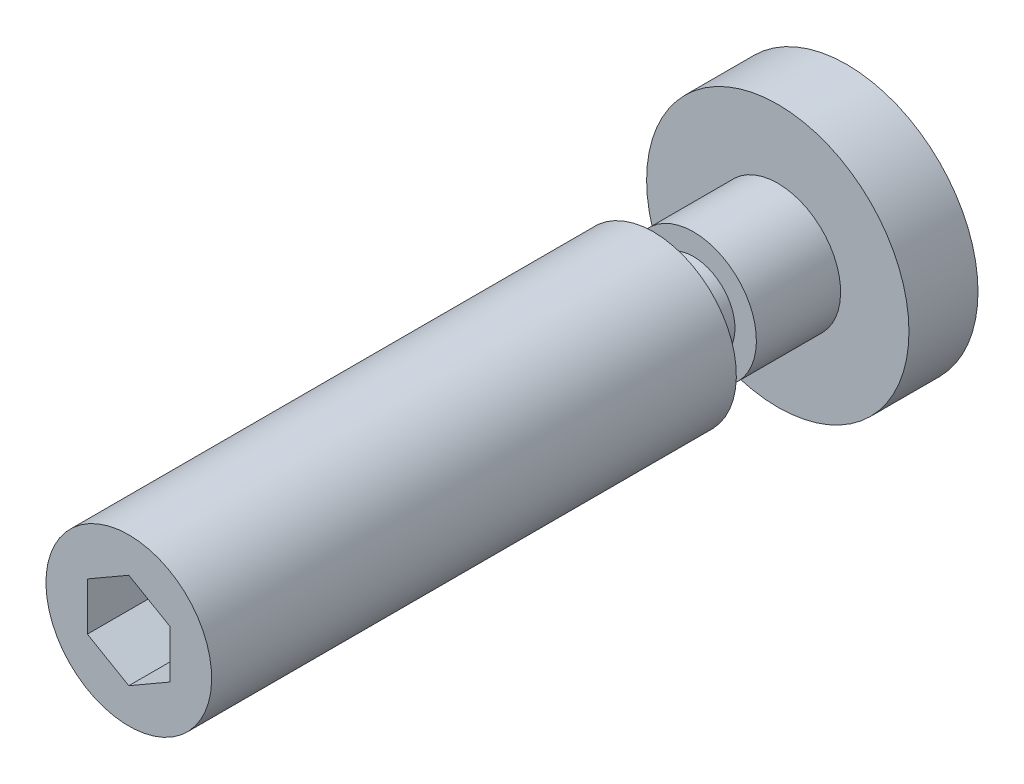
ISO-10303-21;
HEADER;
FILE_DESCRIPTION(('STEP AP214'),'2;1');
FILE_NAME('part.step','',(''),(''),'','','');
FILE_SCHEMA(('AUTOMOTIVE_DESIGN { 1 0 10303 214 1 1 1 1 }'));
ENDSEC;
DATA;
#1=APPLICATION_CONTEXT('core data for automotive mechanical design processes');
#2=APPLICATION_PROTOCOL_DEFINITION('international standard','automotive_design',2000,#1);
#3=PRODUCT_CONTEXT('',#1,'mechanical');
#4=PRODUCT('Part','Part','',(#3));
#5=PRODUCT_RELATED_PRODUCT_CATEGORY('part','',(#4));
#6=PRODUCT_DEFINITION_FORMATION('','',#4);
#7=PRODUCT_DEFINITION_CONTEXT('part definition',#1,'design');
#8=PRODUCT_DEFINITION('design','',#6,#7);
#9=PRODUCT_DEFINITION_SHAPE('','',#8);
#10=(LENGTH_UNIT() NAMED_UNIT(*) SI_UNIT(.MILLI.,.METRE.));
#11=(NAMED_UNIT(*) PLANE_ANGLE_UNIT() SI_UNIT($,.RADIAN.));
#12=(NAMED_UNIT(*) SI_UNIT($,.STERADIAN.) SOLID_ANGLE_UNIT());
#13=UNCERTAINTY_MEASURE_WITH_UNIT(LENGTH_MEASURE(1.E-05),#10,'distance_accuracy_value','');
#14=(GEOMETRIC_REPRESENTATION_CONTEXT(3) GLOBAL_UNCERTAINTY_ASSIGNED_CONTEXT((#13)) GLOBAL_UNIT_ASSIGNED_CONTEXT((#10,
#11,#12)) REPRESENTATION_CONTEXT('',''));
#15=CARTESIAN_POINT('',(0.,0.,0.));
#16=DIRECTION('',(0.,0.,1.));
#17=DIRECTION('',(1.,0.,0.));
#18=AXIS2_PLACEMENT_3D('',#15,#16,#17);
#19=CARTESIAN_POINT('',(0.,0.,0.));
#20=DIRECTION('',(0.,0.,1.));
#21=DIRECTION('',(0.,1.,0.));
#22=AXIS2_PLACEMENT_3D('',#19,#20,#21);
#23=PLANE('',#22);
#24=CARTESIAN_POINT('',(0.,0.,0.));
#25=DIRECTION('',(0.,0.,1.));
#26=DIRECTION('',(0.,1.,0.));
#27=AXIS2_PLACEMENT_3D('',#24,#25,#26);
#28=CIRCLE('',#27,9.5);
#29=CARTESIAN_POINT('',(0.,9.5,0.));
#30=VERTEX_POINT('',#29);
#31=EDGE_CURVE('E9',#30,#30,#28,.T.);
#32=ORIENTED_EDGE('',*,*,#31,.F.);
#33=EDGE_LOOP('',(#32));
#34=FACE_BOUND('',#33,.T.);
#35=ADVANCED_FACE('F14',(#34),#23,.F.);
#36=CARTESIAN_POINT('',(0.,0.,40.));
#37=DIRECTION('',(0.,0.,1.));
#38=DIRECTION('',(0.,1.,0.));
#39=AXIS2_PLACEMENT_3D('',#36,#37,#38);
#40=CYLINDRICAL_SURFACE('',#39,9.5);
#41=CARTESIAN_POINT('',(0.,0.,5.));
#42=DIRECTION('',(0.,0.,1.));
#43=DIRECTION('',(0.,1.,0.));
#44=AXIS2_PLACEMENT_3D('',#41,#42,#43);
#45=CIRCLE('',#44,9.5);
#46=CARTESIAN_POINT('',(0.,9.5,5.));
#47=VERTEX_POINT('',#46);
#48=EDGE_CURVE('E21',#47,#47,#45,.T.);
#49=ORIENTED_EDGE('',*,*,#48,.F.);
#50=EDGE_LOOP('',(#49));
#51=FACE_BOUND('',#50,.T.);
#52=ORIENTED_EDGE('',*,*,#31,.T.);
#53=EDGE_LOOP('',(#52));
#54=FACE_BOUND('',#53,.T.);
#55=ADVANCED_FACE('F142',(#51,#54),#40,.T.);
#56=CARTESIAN_POINT('',(0.,-9.5,5.));
#57=DIRECTION('',(0.,0.,-1.));
#58=DIRECTION('',(0.,-1.,0.));
#59=AXIS2_PLACEMENT_3D('',#56,#57,#58);
#60=PLANE('',#59);
#61=CARTESIAN_POINT('',(0.,0.,5.));
#62=DIRECTION('',(0.,0.,1.));
#63=DIRECTION('',(0.,1.,0.));
#64=AXIS2_PLACEMENT_3D('',#61,#62,#63);
#65=CIRCLE('',#64,4.55);
#66=CARTESIAN_POINT('',(0.,4.55,5.));
#67=VERTEX_POINT('',#66);
#68=EDGE_CURVE('E135',#67,#67,#65,.T.);
#69=ORIENTED_EDGE('',*,*,#68,.F.);
#70=EDGE_LOOP('',(#69));
#71=FACE_BOUND('',#70,.T.);
#72=ORIENTED_EDGE('',*,*,#48,.T.);
#73=EDGE_LOOP('',(#72));
#74=FACE_BOUND('',#73,.T.);
#75=ADVANCED_FACE('F140',(#71,#74),#60,.F.);
#76=CARTESIAN_POINT('',(0.,0.,40.));
#77=DIRECTION('',(0.,0.,1.));
#78=DIRECTION('',(0.,1.,0.));
#79=AXIS2_PLACEMENT_3D('',#76,#77,#78);
#80=CYLINDRICAL_SURFACE('',#79,4.55);
#81=CARTESIAN_POINT('',(0.,0.,11.1));
#82=DIRECTION('',(0.,0.,1.));
#83=DIRECTION('',(0.,1.,0.));
#84=AXIS2_PLACEMENT_3D('',#81,#82,#83);
#85=CIRCLE('',#84,4.55);
#86=CARTESIAN_POINT('',(0.,4.55,11.1));
#87=VERTEX_POINT('',#86);
#88=EDGE_CURVE('E132',#87,#87,#85,.T.);
#89=ORIENTED_EDGE('',*,*,#88,.F.);
#90=EDGE_LOOP('',(#89));
#91=FACE_BOUND('',#90,.T.);
#92=ORIENTED_EDGE('',*,*,#68,.T.);
#93=EDGE_LOOP('',(#92));
#94=FACE_BOUND('',#93,.T.);
#95=ADVANCED_FACE('F165',(#91,#94),#80,.T.);
#96=CARTESIAN_POINT('',(0.,-4.55,11.1));
#97=DIRECTION('',(0.,0.,-1.));
#98=DIRECTION('',(0.,-1.,0.));
#99=AXIS2_PLACEMENT_3D('',#96,#97,#98);
#100=PLANE('',#99);
#101=CARTESIAN_POINT('',(0.,0.,11.1));
#102=DIRECTION('',(0.,0.,1.));
#103=DIRECTION('',(0.,1.,0.));
#104=AXIS2_PLACEMENT_3D('',#101,#102,#103);
#105=CIRCLE('',#104,3.);
#106=CARTESIAN_POINT('',(0.,3.,11.1));
#107=VERTEX_POINT('',#106);
#108=EDGE_CURVE('E129',#107,#107,#105,.T.);
#109=ORIENTED_EDGE('',*,*,#108,.F.);
#110=EDGE_LOOP('',(#109));
#111=FACE_BOUND('',#110,.T.);
#112=ORIENTED_EDGE('',*,*,#88,.T.);
#113=EDGE_LOOP('',(#112));
#114=FACE_BOUND('',#113,.T.);
#115=ADVANCED_FACE('F174',(#111,#114),#100,.F.);
#116=CARTESIAN_POINT('',(0.,0.,40.));
#117=DIRECTION('',(0.,0.,1.));
#118=DIRECTION('',(0.,1.,0.));
#119=AXIS2_PLACEMENT_3D('',#116,#117,#118);
#120=CYLINDRICAL_SURFACE('',#119,3.);
#121=CARTESIAN_POINT('',(0.,0.,14.));
#122=DIRECTION('',(0.,0.,1.));
#123=DIRECTION('',(0.,1.,0.));
#124=AXIS2_PLACEMENT_3D('',#121,#122,#123);
#125=CIRCLE('',#124,3.);
#126=CARTESIAN_POINT('',(0.,3.,14.));
#127=VERTEX_POINT('',#126);
#128=EDGE_CURVE('E126',#127,#127,#125,.T.);
#129=ORIENTED_EDGE('',*,*,#128,.F.);
#130=EDGE_LOOP('',(#129));
#131=FACE_BOUND('',#130,.T.);
#132=ORIENTED_EDGE('',*,*,#108,.T.);
#133=EDGE_LOOP('',(#132));
#134=FACE_BOUND('',#133,.T.);
#135=ADVANCED_FACE('F183',(#131,#134),#120,.T.);
#136=CARTESIAN_POINT('',(0.,-3.,14.));
#137=DIRECTION('',(0.,0.,1.));
#138=DIRECTION('',(0.,1.,0.));
#139=AXIS2_PLACEMENT_3D('',#136,#137,#138);
#140=PLANE('',#139);
#141=CARTESIAN_POINT('',(0.,0.,14.));
#142=DIRECTION('',(0.,0.,1.));
#143=DIRECTION('',(0.,1.,0.));
#144=AXIS2_PLACEMENT_3D('',#141,#142,#143);
#145=CIRCLE('',#144,6.);
#146=CARTESIAN_POINT('',(0.,6.,14.));
#147=VERTEX_POINT('',#146);
#148=EDGE_CURVE('E123',#147,#147,#145,.T.);
#149=ORIENTED_EDGE('',*,*,#148,.F.);
#150=EDGE_LOOP('',(#149));
#151=FACE_BOUND('',#150,.T.);
#152=ORIENTED_EDGE('',*,*,#128,.T.);
#153=EDGE_LOOP('',(#152));
#154=FACE_BOUND('',#153,.T.);
#155=ADVANCED_FACE('F192',(#151,#154),#140,.F.);
#156=CARTESIAN_POINT('',(0.,0.,40.));
#157=DIRECTION('',(0.,0.,1.));
#158=DIRECTION('',(0.,1.,0.));
#159=AXIS2_PLACEMENT_3D('',#156,#157,#158);
#160=CYLINDRICAL_SURFACE('',#159,6.);
#161=CARTESIAN_POINT('',(0.,0.,52.));
#162=DIRECTION('',(0.,0.,1.));
#163=DIRECTION('',(0.,1.,0.));
#164=AXIS2_PLACEMENT_3D('',#161,#162,#163);
#165=CIRCLE('',#164,6.);
#166=CARTESIAN_POINT('',(0.,6.,52.));
#167=VERTEX_POINT('',#166);
#168=EDGE_CURVE('E115',#167,#167,#165,.T.);
#169=ORIENTED_EDGE('',*,*,#168,.F.);
#170=EDGE_LOOP('',(#169));
#171=FACE_BOUND('',#170,.T.);
#172=ORIENTED_EDGE('',*,*,#148,.T.);
#173=EDGE_LOOP('',(#172));
#174=FACE_BOUND('',#173,.T.);
#175=ADVANCED_FACE('F201',(#171,#174),#160,.T.);
#176=CARTESIAN_POINT('',(0.,-6.,52.));
#177=DIRECTION('',(0.,0.,-1.));
#178=DIRECTION('',(0.,-1.,0.));
#179=AXIS2_PLACEMENT_3D('',#176,#177,#178);
#180=PLANE('',#179);
#181=DIRECTION('',(-0.866025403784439,-0.5,0.));
#182=VECTOR('',#181,1.);
#183=CARTESIAN_POINT('',(0.,3.46410161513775,52.));
#184=LINE('',#183,#182);
#185=CARTESIAN_POINT('',(0.,3.46410161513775,52.));
#186=VERTEX_POINT('',#185);
#187=CARTESIAN_POINT('',(-3.,1.73205080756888,52.));
#188=VERTEX_POINT('',#187);
#189=EDGE_CURVE('E102',#186,#188,#184,.T.);
#190=ORIENTED_EDGE('',*,*,#189,.F.);
#191=DIRECTION('',(-0.866025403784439,0.5,0.));
#192=VECTOR('',#191,1.);
#193=CARTESIAN_POINT('',(3.,1.73205080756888,52.));
#194=LINE('',#193,#192);
#195=CARTESIAN_POINT('',(3.,1.73205080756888,52.));
#196=VERTEX_POINT('',#195);
#197=EDGE_CURVE('E28',#196,#186,#194,.T.);
#198=ORIENTED_EDGE('',*,*,#197,.F.);
#199=DIRECTION('',(0.,1.,0.));
#200=VECTOR('',#199,1.);
#201=CARTESIAN_POINT('',(3.,-1.73205080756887,52.));
#202=LINE('',#201,#200);
#203=CARTESIAN_POINT('',(3.,-1.73205080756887,52.));
#204=VERTEX_POINT('',#203);
#205=EDGE_CURVE('E111',#204,#196,#202,.T.);
#206=ORIENTED_EDGE('',*,*,#205,.F.);
#207=DIRECTION('',(0.866025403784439,0.5,0.));
#208=VECTOR('',#207,1.);
#209=CARTESIAN_POINT('',(0.,-3.46410161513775,52.));
#210=LINE('',#209,#208);
#211=CARTESIAN_POINT('',(0.,-3.46410161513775,52.));
#212=VERTEX_POINT('',#211);
#213=EDGE_CURVE('E109',#212,#204,#210,.T.);
#214=ORIENTED_EDGE('',*,*,#213,.F.);
#215=DIRECTION('',(0.866025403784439,-0.5,0.));
#216=VECTOR('',#215,1.);
#217=CARTESIAN_POINT('',(-3.,-1.73205080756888,52.));
#218=LINE('',#217,#216);
#219=CARTESIAN_POINT('',(-3.,-1.73205080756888,52.));
#220=VERTEX_POINT('',#219);
#221=EDGE_CURVE('E76',#220,#212,#218,.T.);
#222=ORIENTED_EDGE('',*,*,#221,.F.);
#223=DIRECTION('',(0.,-1.,0.));
#224=VECTOR('',#223,1.);
#225=CARTESIAN_POINT('',(-3.,1.73205080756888,52.));
#226=LINE('',#225,#224);
#227=EDGE_CURVE('E105',#188,#220,#226,.T.);
#228=ORIENTED_EDGE('',*,*,#227,.F.);
#229=EDGE_LOOP('',(#190,#198,#206,#214,#222,#228));
#230=FACE_BOUND('',#229,.T.);
#231=ORIENTED_EDGE('',*,*,#168,.T.);
#232=EDGE_LOOP('',(#231));
#233=FACE_BOUND('',#232,.T.);
#234=ADVANCED_FACE('F210',(#230,#233),#180,.F.);
#235=CARTESIAN_POINT('',(3.,1.73205080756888,44.));
#236=DIRECTION('',(0.5,0.866025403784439,0.));
#237=DIRECTION('',(-0.866025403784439,0.5,0.));
#238=AXIS2_PLACEMENT_3D('',#235,#236,#237);
#239=PLANE('',#238);
#240=ORIENTED_EDGE('',*,*,#197,.T.);
#241=DIRECTION('',(0.,0.,1.));
#242=VECTOR('',#241,1.);
#243=CARTESIAN_POINT('',(0.,3.46410161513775,44.));
#244=LINE('',#243,#242);
#245=CARTESIAN_POINT('',(0.,3.46410161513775,44.));
#246=VERTEX_POINT('',#245);
#247=EDGE_CURVE('E58',#246,#186,#244,.T.);
#248=ORIENTED_EDGE('',*,*,#247,.F.);
#249=DIRECTION('',(-0.866025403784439,0.5,0.));
#250=VECTOR('',#249,1.);
#251=CARTESIAN_POINT('',(3.,1.73205080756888,44.));
#252=LINE('',#251,#250);
#253=CARTESIAN_POINT('',(3.,1.73205080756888,44.));
#254=VERTEX_POINT('',#253);
#255=EDGE_CURVE('E113',#254,#246,#252,.T.);
#256=ORIENTED_EDGE('',*,*,#255,.F.);
#257=DIRECTION('',(0.,0.,1.));
#258=VECTOR('',#257,1.);
#259=CARTESIAN_POINT('',(3.,1.73205080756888,44.));
#260=LINE('',#259,#258);
#261=EDGE_CURVE('E36',#254,#196,#260,.T.);
#262=ORIENTED_EDGE('',*,*,#261,.T.);
#263=EDGE_LOOP('',(#240,#248,#256,#262));
#264=FACE_BOUND('',#263,.T.);
#265=ADVANCED_FACE('F219',(#264),#239,.F.);
#266=CARTESIAN_POINT('',(3.,-1.73205080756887,44.));
#267=DIRECTION('',(1.,0.,0.));
#268=DIRECTION('',(0.,1.,0.));
#269=AXIS2_PLACEMENT_3D('',#266,#267,#268);
#270=PLANE('',#269);
#271=ORIENTED_EDGE('',*,*,#205,.T.);
#272=ORIENTED_EDGE('',*,*,#261,.F.);
#273=DIRECTION('',(0.,1.,0.));
#274=VECTOR('',#273,1.);
#275=CARTESIAN_POINT('',(3.,-1.73205080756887,44.));
#276=LINE('',#275,#274);
#277=CARTESIAN_POINT('',(3.,-1.73205080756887,44.));
#278=VERTEX_POINT('',#277);
#279=EDGE_CURVE('E88',#278,#254,#276,.T.);
#280=ORIENTED_EDGE('',*,*,#279,.F.);
#281=DIRECTION('',(0.,0.,1.));
#282=VECTOR('',#281,1.);
#283=CARTESIAN_POINT('',(3.,-1.73205080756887,44.));
#284=LINE('',#283,#282);
#285=EDGE_CURVE('E80',#278,#204,#284,.T.);
#286=ORIENTED_EDGE('',*,*,#285,.T.);
#287=EDGE_LOOP('',(#271,#272,#280,#286));
#288=FACE_BOUND('',#287,.T.);
#289=ADVANCED_FACE('F228',(#288),#270,.F.);
#290=CARTESIAN_POINT('',(0.,-3.46410161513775,44.));
#291=DIRECTION('',(0.5,-0.866025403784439,0.));
#292=DIRECTION('',(0.866025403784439,0.5,0.));
#293=AXIS2_PLACEMENT_3D('',#290,#291,#292);
#294=PLANE('',#293);
#295=ORIENTED_EDGE('',*,*,#213,.T.);
#296=ORIENTED_EDGE('',*,*,#285,.F.);
#297=DIRECTION('',(0.866025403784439,0.5,0.));
#298=VECTOR('',#297,1.);
#299=CARTESIAN_POINT('',(0.,-3.46410161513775,44.));
#300=LINE('',#299,#298);
#301=CARTESIAN_POINT('',(0.,-3.46410161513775,44.));
#302=VERTEX_POINT('',#301);
#303=EDGE_CURVE('E84',#302,#278,#300,.T.);
#304=ORIENTED_EDGE('',*,*,#303,.F.);
#305=DIRECTION('',(0.,0.,1.));
#306=VECTOR('',#305,1.);
#307=CARTESIAN_POINT('',(0.,-3.46410161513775,44.));
#308=LINE('',#307,#306);
#309=EDGE_CURVE('E69',#302,#212,#308,.T.);
#310=ORIENTED_EDGE('',*,*,#309,.T.);
#311=EDGE_LOOP('',(#295,#296,#304,#310));
#312=FACE_BOUND('',#311,.T.);
#313=ADVANCED_FACE('F85',(#312),#294,.F.);
#314=CARTESIAN_POINT('',(-3.,-1.73205080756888,44.));
#315=DIRECTION('',(-0.5,-0.866025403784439,0.));
#316=DIRECTION('',(0.866025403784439,-0.5,0.));
#317=AXIS2_PLACEMENT_3D('',#314,#315,#316);
#318=PLANE('',#317);
#319=ORIENTED_EDGE('',*,*,#221,.T.);
#320=ORIENTED_EDGE('',*,*,#309,.F.);
#321=DIRECTION('',(0.866025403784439,-0.5,0.));
#322=VECTOR('',#321,1.);
#323=CARTESIAN_POINT('',(-3.,-1.73205080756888,44.));
#324=LINE('',#323,#322);
#325=CARTESIAN_POINT('',(-3.,-1.73205080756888,44.));
#326=VERTEX_POINT('',#325);
#327=EDGE_CURVE('E73',#326,#302,#324,.T.);
#328=ORIENTED_EDGE('',*,*,#327,.F.);
#329=DIRECTION('',(0.,0.,1.));
#330=VECTOR('',#329,1.);
#331=CARTESIAN_POINT('',(-3.,-1.73205080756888,44.));
#332=LINE('',#331,#330);
#333=EDGE_CURVE('E81',#326,#220,#332,.T.);
#334=ORIENTED_EDGE('',*,*,#333,.T.);
#335=EDGE_LOOP('',(#319,#320,#328,#334));
#336=FACE_BOUND('',#335,.T.);
#337=ADVANCED_FACE('F71',(#336),#318,.F.);
#338=CARTESIAN_POINT('',(-3.,1.73205080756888,44.));
#339=DIRECTION('',(-1.,0.,0.));
#340=DIRECTION('',(0.,-1.,0.));
#341=AXIS2_PLACEMENT_3D('',#338,#339,#340);
#342=PLANE('',#341);
#343=ORIENTED_EDGE('',*,*,#227,.T.);
#344=ORIENTED_EDGE('',*,*,#333,.F.);
#345=DIRECTION('',(0.,-1.,0.));
#346=VECTOR('',#345,1.);
#347=CARTESIAN_POINT('',(-3.,1.73205080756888,44.));
#348=LINE('',#347,#346);
#349=CARTESIAN_POINT('',(-3.,1.73205080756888,44.));
#350=VERTEX_POINT('',#349);
#351=EDGE_CURVE('E94',#350,#326,#348,.T.);
#352=ORIENTED_EDGE('',*,*,#351,.F.);
#353=DIRECTION('',(0.,0.,1.));
#354=VECTOR('',#353,1.);
#355=CARTESIAN_POINT('',(-3.,1.73205080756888,44.));
#356=LINE('',#355,#354);
#357=EDGE_CURVE('E118',#350,#188,#356,.T.);
#358=ORIENTED_EDGE('',*,*,#357,.T.);
#359=EDGE_LOOP('',(#343,#344,#352,#358));
#360=FACE_BOUND('',#359,.T.);
#361=ADVANCED_FACE('F250',(#360),#342,.F.);
#362=CARTESIAN_POINT('',(0.,3.46410161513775,44.));
#363=DIRECTION('',(-0.5,0.866025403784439,0.));
#364=DIRECTION('',(-0.866025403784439,-0.5,0.));
#365=AXIS2_PLACEMENT_3D('',#362,#363,#364);
#366=PLANE('',#365);
#367=ORIENTED_EDGE('',*,*,#189,.T.);
#368=ORIENTED_EDGE('',*,*,#357,.F.);
#369=DIRECTION('',(-0.866025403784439,-0.5,0.));
#370=VECTOR('',#369,1.);
#371=CARTESIAN_POINT('',(0.,3.46410161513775,44.));
#372=LINE('',#371,#370);
#373=EDGE_CURVE('E96',#246,#350,#372,.T.);
#374=ORIENTED_EDGE('',*,*,#373,.F.);
#375=ORIENTED_EDGE('',*,*,#247,.T.);
#376=EDGE_LOOP('',(#367,#368,#374,#375));
#377=FACE_BOUND('',#376,.T.);
#378=ADVANCED_FACE('F258',(#377),#366,.F.);
#379=CARTESIAN_POINT('',(0.,3.46410161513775,44.));
#380=DIRECTION('',(0.,0.,1.));
#381=DIRECTION('',(1.,0.,0.));
#382=AXIS2_PLACEMENT_3D('',#379,#380,#381);
#383=PLANE('',#382);
#384=ORIENTED_EDGE('',*,*,#255,.T.);
#385=ORIENTED_EDGE('',*,*,#373,.T.);
#386=ORIENTED_EDGE('',*,*,#351,.T.);
#387=ORIENTED_EDGE('',*,*,#327,.T.);
#388=ORIENTED_EDGE('',*,*,#303,.T.);
#389=ORIENTED_EDGE('',*,*,#279,.T.);
#390=EDGE_LOOP('',(#384,#385,#386,#387,#388,#389));
#391=FACE_BOUND('',#390,.T.);
#392=ADVANCED_FACE('F91',(#391),#383,.T.);
#393=CLOSED_SHELL('',(#35,#55,#75,#95,#115,#135,#155,#175,#234,#265,#289,#313,#337,#361,#378,#392));
#394=MANIFOLD_SOLID_BREP('B1',#393);
#395=ADVANCED_BREP_SHAPE_REPRESENTATION('',(#18,#394),#14);
#396=SHAPE_DEFINITION_REPRESENTATION(#9,#395);
ENDSEC;
END-ISO-10303-21;
